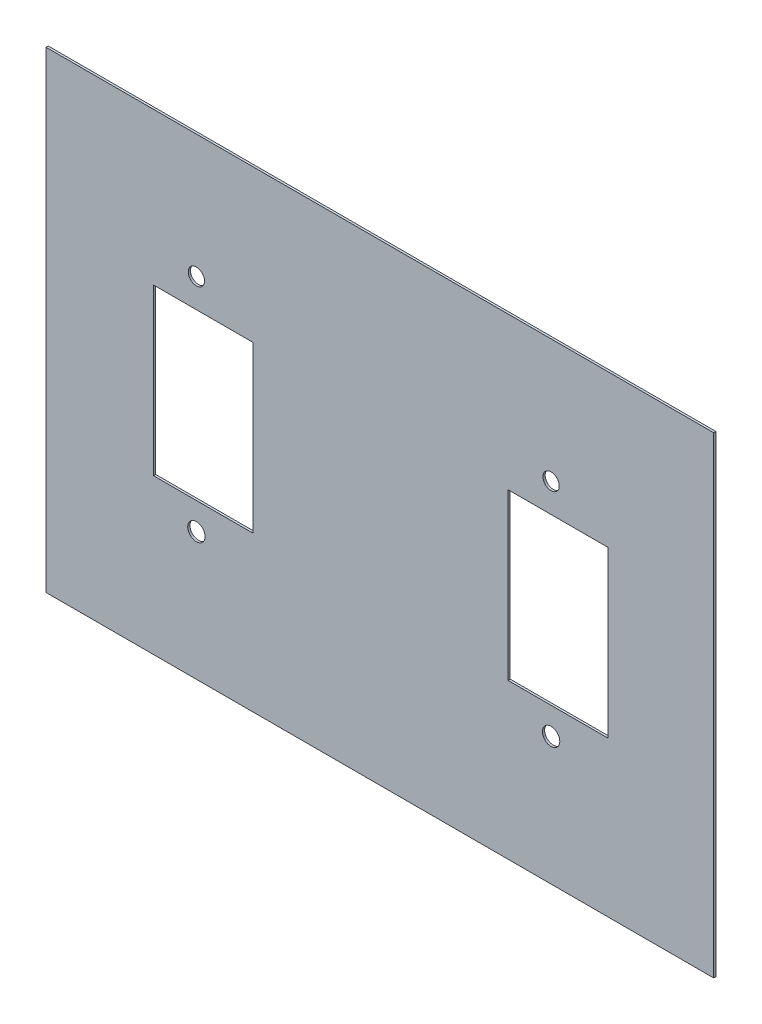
ISO-10303-21;
HEADER;
FILE_DESCRIPTION(('STEP AP214'),'2;1');
FILE_NAME('part.step','',(''),(''),'','','');
FILE_SCHEMA(('AUTOMOTIVE_DESIGN { 1 0 10303 214 1 1 1 1 }'));
ENDSEC;
DATA;
#1=APPLICATION_CONTEXT('core data for automotive mechanical design processes');
#2=APPLICATION_PROTOCOL_DEFINITION('international standard','automotive_design',2000,#1);
#3=PRODUCT_CONTEXT('',#1,'mechanical');
#4=PRODUCT('Part','Part','',(#3));
#5=PRODUCT_RELATED_PRODUCT_CATEGORY('part','',(#4));
#6=PRODUCT_DEFINITION_FORMATION('','',#4);
#7=PRODUCT_DEFINITION_CONTEXT('part definition',#1,'design');
#8=PRODUCT_DEFINITION('design','',#6,#7);
#9=PRODUCT_DEFINITION_SHAPE('','',#8);
#10=(LENGTH_UNIT() NAMED_UNIT(*) SI_UNIT(.MILLI.,.METRE.));
#11=(NAMED_UNIT(*) PLANE_ANGLE_UNIT() SI_UNIT($,.RADIAN.));
#12=(NAMED_UNIT(*) SI_UNIT($,.STERADIAN.) SOLID_ANGLE_UNIT());
#13=UNCERTAINTY_MEASURE_WITH_UNIT(LENGTH_MEASURE(1.E-05),#10,'distance_accuracy_value','');
#14=(GEOMETRIC_REPRESENTATION_CONTEXT(3) GLOBAL_UNCERTAINTY_ASSIGNED_CONTEXT((#13)) GLOBAL_UNIT_ASSIGNED_CONTEXT((#10,
#11,#12)) REPRESENTATION_CONTEXT('',''));
#15=CARTESIAN_POINT('',(0.,0.,0.));
#16=DIRECTION('',(0.,0.,1.));
#17=DIRECTION('',(1.,0.,0.));
#18=AXIS2_PLACEMENT_3D('',#15,#16,#17);
#19=CARTESIAN_POINT('',(-292.934613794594,286.400756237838,2.54));
#20=DIRECTION('',(1.,0.,0.));
#21=DIRECTION('',(0.,0.,-1.));
#22=AXIS2_PLACEMENT_3D('',#19,#20,#21);
#23=PLANE('',#22);
#24=DIRECTION('',(0.,-1.,0.));
#25=VECTOR('',#24,1.);
#26=CARTESIAN_POINT('',(-292.934613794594,286.400756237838,0.));
#27=LINE('',#26,#25);
#28=CARTESIAN_POINT('',(-292.934613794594,286.400756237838,0.));
#29=VERTEX_POINT('',#28);
#30=CARTESIAN_POINT('',(-292.934613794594,-254.618343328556,0.));
#31=VERTEX_POINT('',#30);
#32=EDGE_CURVE('E144',#29,#31,#27,.T.);
#33=ORIENTED_EDGE('',*,*,#32,.T.);
#34=DIRECTION('',(0.,0.,-1.));
#35=VECTOR('',#34,1.);
#36=CARTESIAN_POINT('',(-292.934613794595,-254.618343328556,1662.15136427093));
#37=LINE('',#36,#35);
#38=CARTESIAN_POINT('',(-292.934613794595,-254.618343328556,2.53999999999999));
#39=VERTEX_POINT('',#38);
#40=EDGE_CURVE('E44',#39,#31,#37,.T.);
#41=ORIENTED_EDGE('',*,*,#40,.F.);
#42=DIRECTION('',(0.,-1.,0.));
#43=VECTOR('',#42,1.);
#44=CARTESIAN_POINT('',(-292.934613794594,286.400756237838,2.54));
#45=LINE('',#44,#43);
#46=CARTESIAN_POINT('',(-292.934613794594,286.400756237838,2.54));
#47=VERTEX_POINT('',#46);
#48=EDGE_CURVE('E130',#47,#39,#45,.T.);
#49=ORIENTED_EDGE('',*,*,#48,.F.);
#50=DIRECTION('',(0.,0.,-1.));
#51=VECTOR('',#50,1.);
#52=CARTESIAN_POINT('',(-292.934613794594,286.400756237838,2.54));
#53=LINE('',#52,#51);
#54=EDGE_CURVE('E138',#47,#29,#53,.T.);
#55=ORIENTED_EDGE('',*,*,#54,.T.);
#56=EDGE_LOOP('',(#33,#41,#49,#55));
#57=FACE_BOUND('',#56,.T.);
#58=ADVANCED_FACE('F30',(#57),#23,.F.);
#59=CARTESIAN_POINT('',(472.05362042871,286.400756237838,2.54));
#60=DIRECTION('',(-1.,0.,0.));
#61=DIRECTION('',(0.,-1.,0.));
#62=AXIS2_PLACEMENT_3D('',#59,#60,#61);
#63=PLANE('',#62);
#64=DIRECTION('',(0.,1.,0.));
#65=VECTOR('',#64,1.);
#66=CARTESIAN_POINT('',(472.05362042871,286.400756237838,2.54));
#67=LINE('',#66,#65);
#68=CARTESIAN_POINT('',(472.05362042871,-254.618343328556,2.53999999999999));
#69=VERTEX_POINT('',#68);
#70=CARTESIAN_POINT('',(472.05362042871,286.400756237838,2.54));
#71=VERTEX_POINT('',#70);
#72=EDGE_CURVE('E127',#69,#71,#67,.T.);
#73=ORIENTED_EDGE('',*,*,#72,.F.);
#74=DIRECTION('',(0.,0.,-1.));
#75=VECTOR('',#74,1.);
#76=CARTESIAN_POINT('',(472.05362042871,-254.618343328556,1662.15136427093));
#77=LINE('',#76,#75);
#78=CARTESIAN_POINT('',(472.05362042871,-254.618343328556,0.));
#79=VERTEX_POINT('',#78);
#80=EDGE_CURVE('E115',#69,#79,#77,.T.);
#81=ORIENTED_EDGE('',*,*,#80,.T.);
#82=DIRECTION('',(0.,1.,0.));
#83=VECTOR('',#82,1.);
#84=CARTESIAN_POINT('',(472.05362042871,286.400756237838,0.));
#85=LINE('',#84,#83);
#86=CARTESIAN_POINT('',(472.05362042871,286.400756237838,0.));
#87=VERTEX_POINT('',#86);
#88=EDGE_CURVE('E147',#79,#87,#85,.T.);
#89=ORIENTED_EDGE('',*,*,#88,.T.);
#90=DIRECTION('',(0.,0.,-1.));
#91=VECTOR('',#90,1.);
#92=CARTESIAN_POINT('',(472.05362042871,286.400756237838,2.54));
#93=LINE('',#92,#91);
#94=EDGE_CURVE('E37',#71,#87,#93,.T.);
#95=ORIENTED_EDGE('',*,*,#94,.F.);
#96=EDGE_LOOP('',(#73,#81,#89,#95));
#97=FACE_BOUND('',#96,.T.);
#98=ADVANCED_FACE('F133',(#97),#63,.F.);
#99=CARTESIAN_POINT('',(-292.934613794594,286.400756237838,2.54));
#100=DIRECTION('',(0.,-1.,0.));
#101=DIRECTION('',(0.,0.,-1.));
#102=AXIS2_PLACEMENT_3D('',#99,#100,#101);
#103=PLANE('',#102);
#104=DIRECTION('',(-1.,0.,0.));
#105=VECTOR('',#104,1.);
#106=CARTESIAN_POINT('',(-292.934613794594,286.400756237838,0.));
#107=LINE('',#106,#105);
#108=EDGE_CURVE('E140',#87,#29,#107,.T.);
#109=ORIENTED_EDGE('',*,*,#108,.T.);
#110=ORIENTED_EDGE('',*,*,#54,.F.);
#111=DIRECTION('',(-1.,0.,0.));
#112=VECTOR('',#111,1.);
#113=CARTESIAN_POINT('',(-292.934613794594,286.400756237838,2.54));
#114=LINE('',#113,#112);
#115=EDGE_CURVE('E136',#71,#47,#114,.T.);
#116=ORIENTED_EDGE('',*,*,#115,.F.);
#117=ORIENTED_EDGE('',*,*,#94,.T.);
#118=EDGE_LOOP('',(#109,#110,#116,#117));
#119=FACE_BOUND('',#118,.T.);
#120=ADVANCED_FACE('F154',(#119),#103,.F.);
#121=CARTESIAN_POINT('',(-292.934613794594,-795.63744289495,2.54));
#122=DIRECTION('',(0.,0.,1.));
#123=DIRECTION('',(1.,0.,0.));
#124=AXIS2_PLACEMENT_3D('',#121,#122,#123);
#125=PLANE('',#124);
#126=DIRECTION('',(-1.,0.,0.));
#127=VECTOR('',#126,1.);
#128=CARTESIAN_POINT('',(-292.934613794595,-254.618343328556,2.54));
#129=LINE('',#128,#127);
#130=EDGE_CURVE('E118',#69,#39,#129,.T.);
#131=ORIENTED_EDGE('',*,*,#130,.F.);
#132=ORIENTED_EDGE('',*,*,#72,.T.);
#133=ORIENTED_EDGE('',*,*,#115,.T.);
#134=ORIENTED_EDGE('',*,*,#48,.T.);
#135=EDGE_LOOP('',(#131,#132,#133,#134));
#136=FACE_BOUND('',#135,.T.);
#137=CARTESIAN_POINT('',(285.716630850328,-108.095305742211,2.54));
#138=DIRECTION('',(0.,0.,1.));
#139=DIRECTION('',(1.,0.,0.));
#140=AXIS2_PLACEMENT_3D('',#137,#138,#139);
#141=CIRCLE('',#140,9.95883906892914);
#142=CARTESIAN_POINT('',(295.675469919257,-108.095305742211,2.54));
#143=VERTEX_POINT('',#142);
#144=EDGE_CURVE('E131',#143,#143,#141,.T.);
#145=ORIENTED_EDGE('',*,*,#144,.F.);
#146=EDGE_LOOP('',(#145));
#147=FACE_BOUND('',#146,.T.);
#148=CARTESIAN_POINT('',(285.716630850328,145.099046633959,2.54));
#149=DIRECTION('',(0.,0.,1.));
#150=DIRECTION('',(1.,0.,0.));
#151=AXIS2_PLACEMENT_3D('',#148,#149,#150);
#152=CIRCLE('',#151,9.33473781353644);
#153=CARTESIAN_POINT('',(295.051368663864,145.099046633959,2.54));
#154=VERTEX_POINT('',#153);
#155=EDGE_CURVE('E165',#154,#154,#152,.T.);
#156=ORIENTED_EDGE('',*,*,#155,.F.);
#157=EDGE_LOOP('',(#156));
#158=FACE_BOUND('',#157,.T.);
#159=DIRECTION('',(0.,-1.,0.));
#160=VECTOR('',#159,1.);
#161=CARTESIAN_POINT('',(236.32626016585,112.096614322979,2.54));
#162=LINE('',#161,#160);
#163=CARTESIAN_POINT('',(236.32626016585,112.096614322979,2.54));
#164=VERTEX_POINT('',#163);
#165=CARTESIAN_POINT('',(236.32626016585,-77.1861627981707,2.54));
#166=VERTEX_POINT('',#165);
#167=EDGE_CURVE('E51',#164,#166,#162,.T.);
#168=ORIENTED_EDGE('',*,*,#167,.F.);
#169=DIRECTION('',(-1.,0.,0.));
#170=VECTOR('',#169,1.);
#171=CARTESIAN_POINT('',(236.32626016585,112.096614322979,2.54));
#172=LINE('',#171,#170);
#173=CARTESIAN_POINT('',(350.752480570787,112.096614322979,2.54));
#174=VERTEX_POINT('',#173);
#175=EDGE_CURVE('E177',#174,#164,#172,.T.);
#176=ORIENTED_EDGE('',*,*,#175,.F.);
#177=DIRECTION('',(0.,1.,0.));
#178=VECTOR('',#177,1.);
#179=CARTESIAN_POINT('',(350.752480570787,112.096614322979,2.54));
#180=LINE('',#179,#178);
#181=CARTESIAN_POINT('',(350.752480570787,-77.1861627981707,2.54));
#182=VERTEX_POINT('',#181);
#183=EDGE_CURVE('E191',#182,#174,#180,.T.);
#184=ORIENTED_EDGE('',*,*,#183,.F.);
#185=DIRECTION('',(1.,0.,0.));
#186=VECTOR('',#185,1.);
#187=CARTESIAN_POINT('',(236.32626016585,-77.1861627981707,2.54));
#188=LINE('',#187,#186);
#189=EDGE_CURVE('E188',#166,#182,#188,.T.);
#190=ORIENTED_EDGE('',*,*,#189,.F.);
#191=EDGE_LOOP('',(#168,#176,#184,#190));
#192=FACE_BOUND('',#191,.T.);
#193=CARTESIAN_POINT('',(-120.683369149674,-108.095305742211,2.54));
#194=DIRECTION('',(0.,0.,1.));
#195=DIRECTION('',(1.,0.,0.));
#196=AXIS2_PLACEMENT_3D('',#193,#194,#195);
#197=CIRCLE('',#196,9.95883906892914);
#198=CARTESIAN_POINT('',(-110.724530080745,-108.095305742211,2.54));
#199=VERTEX_POINT('',#198);
#200=EDGE_CURVE('E198',#199,#199,#197,.T.);
#201=ORIENTED_EDGE('',*,*,#200,.F.);
#202=EDGE_LOOP('',(#201));
#203=FACE_BOUND('',#202,.T.);
#204=CARTESIAN_POINT('',(-120.683369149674,145.099046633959,2.54));
#205=DIRECTION('',(0.,0.,1.));
#206=DIRECTION('',(1.,0.,0.));
#207=AXIS2_PLACEMENT_3D('',#204,#205,#206);
#208=CIRCLE('',#207,9.33473781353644);
#209=CARTESIAN_POINT('',(-111.348631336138,145.099046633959,2.54));
#210=VERTEX_POINT('',#209);
#211=EDGE_CURVE('E207',#210,#210,#208,.T.);
#212=ORIENTED_EDGE('',*,*,#211,.F.);
#213=EDGE_LOOP('',(#212));
#214=FACE_BOUND('',#213,.T.);
#215=DIRECTION('',(0.,-1.,0.));
#216=VECTOR('',#215,1.);
#217=CARTESIAN_POINT('',(-170.073739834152,112.096614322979,2.54));
#218=LINE('',#217,#216);
#219=CARTESIAN_POINT('',(-170.073739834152,112.096614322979,2.54));
#220=VERTEX_POINT('',#219);
#221=CARTESIAN_POINT('',(-170.073739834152,-77.1861627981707,2.54));
#222=VERTEX_POINT('',#221);
#223=EDGE_CURVE('E213',#220,#222,#218,.T.);
#224=ORIENTED_EDGE('',*,*,#223,.F.);
#225=DIRECTION('',(-1.,0.,0.));
#226=VECTOR('',#225,1.);
#227=CARTESIAN_POINT('',(-170.073739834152,112.096614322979,2.54));
#228=LINE('',#227,#226);
#229=CARTESIAN_POINT('',(-55.6475194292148,112.096614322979,2.54));
#230=VERTEX_POINT('',#229);
#231=EDGE_CURVE('E220',#230,#220,#228,.T.);
#232=ORIENTED_EDGE('',*,*,#231,.F.);
#233=DIRECTION('',(0.,1.,0.));
#234=VECTOR('',#233,1.);
#235=CARTESIAN_POINT('',(-55.6475194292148,112.096614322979,2.54));
#236=LINE('',#235,#234);
#237=CARTESIAN_POINT('',(-55.6475194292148,-77.1861627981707,2.54));
#238=VERTEX_POINT('',#237);
#239=EDGE_CURVE('E234',#238,#230,#236,.T.);
#240=ORIENTED_EDGE('',*,*,#239,.F.);
#241=DIRECTION('',(1.,0.,0.));
#242=VECTOR('',#241,1.);
#243=CARTESIAN_POINT('',(-170.073739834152,-77.1861627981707,2.54));
#244=LINE('',#243,#242);
#245=EDGE_CURVE('E231',#222,#238,#244,.T.);
#246=ORIENTED_EDGE('',*,*,#245,.F.);
#247=EDGE_LOOP('',(#224,#232,#240,#246));
#248=FACE_BOUND('',#247,.T.);
#249=ADVANCED_FACE('F125',(#136,#147,#158,#192,#203,#214,#248),#125,.T.);
#250=CARTESIAN_POINT('',(-292.934613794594,-795.63744289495,0.));
#251=DIRECTION('',(0.,0.,1.));
#252=DIRECTION('',(1.,0.,0.));
#253=AXIS2_PLACEMENT_3D('',#250,#251,#252);
#254=PLANE('',#253);
#255=CARTESIAN_POINT('',(285.716630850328,-108.095305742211,0.));
#256=DIRECTION('',(0.,0.,1.));
#257=DIRECTION('',(1.,0.,0.));
#258=AXIS2_PLACEMENT_3D('',#255,#256,#257);
#259=CIRCLE('',#258,9.95883906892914);
#260=CARTESIAN_POINT('',(295.675469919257,-108.095305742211,0.));
#261=VERTEX_POINT('',#260);
#262=EDGE_CURVE('E162',#261,#261,#259,.T.);
#263=ORIENTED_EDGE('',*,*,#262,.T.);
#264=EDGE_LOOP('',(#263));
#265=FACE_BOUND('',#264,.T.);
#266=CARTESIAN_POINT('',(285.716630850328,145.099046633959,0.));
#267=DIRECTION('',(0.,0.,1.));
#268=DIRECTION('',(1.,0.,0.));
#269=AXIS2_PLACEMENT_3D('',#266,#267,#268);
#270=CIRCLE('',#269,9.33473781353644);
#271=CARTESIAN_POINT('',(295.051368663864,145.099046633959,0.));
#272=VERTEX_POINT('',#271);
#273=EDGE_CURVE('E168',#272,#272,#270,.T.);
#274=ORIENTED_EDGE('',*,*,#273,.T.);
#275=EDGE_LOOP('',(#274));
#276=FACE_BOUND('',#275,.T.);
#277=DIRECTION('',(-1.,0.,0.));
#278=VECTOR('',#277,1.);
#279=CARTESIAN_POINT('',(236.32626016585,112.096614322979,0.));
#280=LINE('',#279,#278);
#281=CARTESIAN_POINT('',(350.752480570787,112.096614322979,0.));
#282=VERTEX_POINT('',#281);
#283=CARTESIAN_POINT('',(236.32626016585,112.096614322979,0.));
#284=VERTEX_POINT('',#283);
#285=EDGE_CURVE('E183',#282,#284,#280,.T.);
#286=ORIENTED_EDGE('',*,*,#285,.T.);
#287=DIRECTION('',(0.,-1.,0.));
#288=VECTOR('',#287,1.);
#289=CARTESIAN_POINT('',(236.32626016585,112.096614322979,0.));
#290=LINE('',#289,#288);
#291=CARTESIAN_POINT('',(236.32626016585,-77.1861627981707,0.));
#292=VERTEX_POINT('',#291);
#293=EDGE_CURVE('E173',#284,#292,#290,.T.);
#294=ORIENTED_EDGE('',*,*,#293,.T.);
#295=DIRECTION('',(1.,0.,0.));
#296=VECTOR('',#295,1.);
#297=CARTESIAN_POINT('',(236.32626016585,-77.1861627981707,0.));
#298=LINE('',#297,#296);
#299=CARTESIAN_POINT('',(350.752480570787,-77.1861627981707,0.));
#300=VERTEX_POINT('',#299);
#301=EDGE_CURVE('E176',#292,#300,#298,.T.);
#302=ORIENTED_EDGE('',*,*,#301,.T.);
#303=DIRECTION('',(0.,1.,0.));
#304=VECTOR('',#303,1.);
#305=CARTESIAN_POINT('',(350.752480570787,112.096614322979,0.));
#306=LINE('',#305,#304);
#307=EDGE_CURVE('E180',#300,#282,#306,.T.);
#308=ORIENTED_EDGE('',*,*,#307,.T.);
#309=EDGE_LOOP('',(#286,#294,#302,#308));
#310=FACE_BOUND('',#309,.T.);
#311=CARTESIAN_POINT('',(-120.683369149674,-108.095305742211,0.));
#312=DIRECTION('',(0.,0.,1.));
#313=DIRECTION('',(1.,0.,0.));
#314=AXIS2_PLACEMENT_3D('',#311,#312,#313);
#315=CIRCLE('',#314,9.95883906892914);
#316=CARTESIAN_POINT('',(-110.724530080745,-108.095305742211,0.));
#317=VERTEX_POINT('',#316);
#318=EDGE_CURVE('E204',#317,#317,#315,.T.);
#319=ORIENTED_EDGE('',*,*,#318,.T.);
#320=EDGE_LOOP('',(#319));
#321=FACE_BOUND('',#320,.T.);
#322=CARTESIAN_POINT('',(-120.683369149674,145.099046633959,0.));
#323=DIRECTION('',(0.,0.,1.));
#324=DIRECTION('',(1.,0.,0.));
#325=AXIS2_PLACEMENT_3D('',#322,#323,#324);
#326=CIRCLE('',#325,9.33473781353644);
#327=CARTESIAN_POINT('',(-111.348631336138,145.099046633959,0.));
#328=VERTEX_POINT('',#327);
#329=EDGE_CURVE('E210',#328,#328,#326,.T.);
#330=ORIENTED_EDGE('',*,*,#329,.T.);
#331=EDGE_LOOP('',(#330));
#332=FACE_BOUND('',#331,.T.);
#333=DIRECTION('',(-1.,0.,0.));
#334=VECTOR('',#333,1.);
#335=CARTESIAN_POINT('',(-170.073739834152,112.096614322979,0.));
#336=LINE('',#335,#334);
#337=CARTESIAN_POINT('',(-55.6475194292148,112.096614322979,0.));
#338=VERTEX_POINT('',#337);
#339=CARTESIAN_POINT('',(-170.073739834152,112.096614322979,0.));
#340=VERTEX_POINT('',#339);
#341=EDGE_CURVE('E226',#338,#340,#336,.T.);
#342=ORIENTED_EDGE('',*,*,#341,.T.);
#343=DIRECTION('',(0.,-1.,0.));
#344=VECTOR('',#343,1.);
#345=CARTESIAN_POINT('',(-170.073739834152,112.096614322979,0.));
#346=LINE('',#345,#344);
#347=CARTESIAN_POINT('',(-170.073739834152,-77.1861627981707,0.));
#348=VERTEX_POINT('',#347);
#349=EDGE_CURVE('E216',#340,#348,#346,.T.);
#350=ORIENTED_EDGE('',*,*,#349,.T.);
#351=DIRECTION('',(1.,0.,0.));
#352=VECTOR('',#351,1.);
#353=CARTESIAN_POINT('',(-170.073739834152,-77.1861627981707,0.));
#354=LINE('',#353,#352);
#355=CARTESIAN_POINT('',(-55.6475194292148,-77.1861627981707,0.));
#356=VERTEX_POINT('',#355);
#357=EDGE_CURVE('E219',#348,#356,#354,.T.);
#358=ORIENTED_EDGE('',*,*,#357,.T.);
#359=DIRECTION('',(0.,1.,0.));
#360=VECTOR('',#359,1.);
#361=CARTESIAN_POINT('',(-55.6475194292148,112.096614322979,0.));
#362=LINE('',#361,#360);
#363=EDGE_CURVE('E223',#356,#338,#362,.T.);
#364=ORIENTED_EDGE('',*,*,#363,.T.);
#365=EDGE_LOOP('',(#342,#350,#358,#364));
#366=FACE_BOUND('',#365,.T.);
#367=ORIENTED_EDGE('',*,*,#88,.F.);
#368=DIRECTION('',(-1.,0.,0.));
#369=VECTOR('',#368,1.);
#370=CARTESIAN_POINT('',(-292.934613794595,-254.618343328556,0.));
#371=LINE('',#370,#369);
#372=EDGE_CURVE('E11',#79,#31,#371,.T.);
#373=ORIENTED_EDGE('',*,*,#372,.T.);
#374=ORIENTED_EDGE('',*,*,#32,.F.);
#375=ORIENTED_EDGE('',*,*,#108,.F.);
#376=EDGE_LOOP('',(#367,#373,#374,#375));
#377=FACE_BOUND('',#376,.T.);
#378=ADVANCED_FACE('F158',(#265,#276,#310,#321,#332,#366,#377),#254,.F.);
#379=CARTESIAN_POINT('',(-170.073739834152,112.096614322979,0.));
#380=DIRECTION('',(-1.,0.,0.));
#381=DIRECTION('',(0.,0.,1.));
#382=AXIS2_PLACEMENT_3D('',#379,#380,#381);
#383=PLANE('',#382);
#384=ORIENTED_EDGE('',*,*,#223,.T.);
#385=DIRECTION('',(0.,0.,1.));
#386=VECTOR('',#385,1.);
#387=CARTESIAN_POINT('',(-170.073739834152,-77.1861627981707,0.));
#388=LINE('',#387,#386);
#389=EDGE_CURVE('E229',#348,#222,#388,.T.);
#390=ORIENTED_EDGE('',*,*,#389,.F.);
#391=ORIENTED_EDGE('',*,*,#349,.F.);
#392=DIRECTION('',(0.,0.,1.));
#393=VECTOR('',#392,1.);
#394=CARTESIAN_POINT('',(-170.073739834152,112.096614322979,0.));
#395=LINE('',#394,#393);
#396=EDGE_CURVE('E148',#340,#220,#395,.T.);
#397=ORIENTED_EDGE('',*,*,#396,.T.);
#398=EDGE_LOOP('',(#384,#390,#391,#397));
#399=FACE_BOUND('',#398,.T.);
#400=ADVANCED_FACE('F259',(#399),#383,.F.);
#401=CARTESIAN_POINT('',(-170.073739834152,112.096614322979,0.));
#402=DIRECTION('',(0.,1.,0.));
#403=DIRECTION('',(0.,0.,1.));
#404=AXIS2_PLACEMENT_3D('',#401,#402,#403);
#405=PLANE('',#404);
#406=ORIENTED_EDGE('',*,*,#231,.T.);
#407=ORIENTED_EDGE('',*,*,#396,.F.);
#408=ORIENTED_EDGE('',*,*,#341,.F.);
#409=DIRECTION('',(0.,0.,1.));
#410=VECTOR('',#409,1.);
#411=CARTESIAN_POINT('',(-55.6475194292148,112.096614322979,0.));
#412=LINE('',#411,#410);
#413=EDGE_CURVE('E240',#338,#230,#412,.T.);
#414=ORIENTED_EDGE('',*,*,#413,.T.);
#415=EDGE_LOOP('',(#406,#407,#408,#414));
#416=FACE_BOUND('',#415,.T.);
#417=ADVANCED_FACE('F261',(#416),#405,.F.);
#418=CARTESIAN_POINT('',(-55.6475194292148,112.096614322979,0.));
#419=DIRECTION('',(1.,0.,0.));
#420=DIRECTION('',(0.,0.,-1.));
#421=AXIS2_PLACEMENT_3D('',#418,#419,#420);
#422=PLANE('',#421);
#423=ORIENTED_EDGE('',*,*,#239,.T.);
#424=ORIENTED_EDGE('',*,*,#413,.F.);
#425=ORIENTED_EDGE('',*,*,#363,.F.);
#426=DIRECTION('',(0.,0.,1.));
#427=VECTOR('',#426,1.);
#428=CARTESIAN_POINT('',(-55.6475194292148,-77.1861627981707,0.));
#429=LINE('',#428,#427);
#430=EDGE_CURVE('E242',#356,#238,#429,.T.);
#431=ORIENTED_EDGE('',*,*,#430,.T.);
#432=EDGE_LOOP('',(#423,#424,#425,#431));
#433=FACE_BOUND('',#432,.T.);
#434=ADVANCED_FACE('F256',(#433),#422,.F.);
#435=CARTESIAN_POINT('',(-170.073739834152,-77.1861627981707,0.));
#436=DIRECTION('',(0.,-1.,0.));
#437=DIRECTION('',(0.,0.,-1.));
#438=AXIS2_PLACEMENT_3D('',#435,#436,#437);
#439=PLANE('',#438);
#440=ORIENTED_EDGE('',*,*,#245,.T.);
#441=ORIENTED_EDGE('',*,*,#430,.F.);
#442=ORIENTED_EDGE('',*,*,#357,.F.);
#443=ORIENTED_EDGE('',*,*,#389,.T.);
#444=EDGE_LOOP('',(#440,#441,#442,#443));
#445=FACE_BOUND('',#444,.T.);
#446=ADVANCED_FACE('F247',(#445),#439,.F.);
#447=CARTESIAN_POINT('',(-120.683369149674,145.099046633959,0.));
#448=DIRECTION('',(0.,0.,1.));
#449=DIRECTION('',(1.,0.,0.));
#450=AXIS2_PLACEMENT_3D('',#447,#448,#449);
#451=CYLINDRICAL_SURFACE('',#450,9.33473781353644);
#452=ORIENTED_EDGE('',*,*,#329,.F.);
#453=EDGE_LOOP('',(#452));
#454=FACE_BOUND('',#453,.T.);
#455=ORIENTED_EDGE('',*,*,#211,.T.);
#456=EDGE_LOOP('',(#455));
#457=FACE_BOUND('',#456,.T.);
#458=ADVANCED_FACE('F286',(#454,#457),#451,.F.);
#459=CARTESIAN_POINT('',(-120.683369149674,-108.095305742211,0.));
#460=DIRECTION('',(0.,0.,1.));
#461=DIRECTION('',(1.,0.,0.));
#462=AXIS2_PLACEMENT_3D('',#459,#460,#461);
#463=CYLINDRICAL_SURFACE('',#462,9.95883906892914);
#464=ORIENTED_EDGE('',*,*,#318,.F.);
#465=EDGE_LOOP('',(#464));
#466=FACE_BOUND('',#465,.T.);
#467=ORIENTED_EDGE('',*,*,#200,.T.);
#468=EDGE_LOOP('',(#467));
#469=FACE_BOUND('',#468,.T.);
#470=ADVANCED_FACE('F290',(#466,#469),#463,.F.);
#471=CARTESIAN_POINT('',(236.32626016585,112.096614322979,0.));
#472=DIRECTION('',(-1.,0.,0.));
#473=DIRECTION('',(0.,0.,1.));
#474=AXIS2_PLACEMENT_3D('',#471,#472,#473);
#475=PLANE('',#474);
#476=ORIENTED_EDGE('',*,*,#167,.T.);
#477=DIRECTION('',(0.,0.,1.));
#478=VECTOR('',#477,1.);
#479=CARTESIAN_POINT('',(236.32626016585,-77.1861627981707,0.));
#480=LINE('',#479,#478);
#481=EDGE_CURVE('E186',#292,#166,#480,.T.);
#482=ORIENTED_EDGE('',*,*,#481,.F.);
#483=ORIENTED_EDGE('',*,*,#293,.F.);
#484=DIRECTION('',(0.,0.,1.));
#485=VECTOR('',#484,1.);
#486=CARTESIAN_POINT('',(236.32626016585,112.096614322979,0.));
#487=LINE('',#486,#485);
#488=EDGE_CURVE('E196',#284,#164,#487,.T.);
#489=ORIENTED_EDGE('',*,*,#488,.T.);
#490=EDGE_LOOP('',(#476,#482,#483,#489));
#491=FACE_BOUND('',#490,.T.);
#492=ADVANCED_FACE('F295',(#491),#475,.F.);
#493=CARTESIAN_POINT('',(236.32626016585,112.096614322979,0.));
#494=DIRECTION('',(0.,1.,0.));
#495=DIRECTION('',(0.,0.,1.));
#496=AXIS2_PLACEMENT_3D('',#493,#494,#495);
#497=PLANE('',#496);
#498=ORIENTED_EDGE('',*,*,#175,.T.);
#499=ORIENTED_EDGE('',*,*,#488,.F.);
#500=ORIENTED_EDGE('',*,*,#285,.F.);
#501=DIRECTION('',(0.,0.,1.));
#502=VECTOR('',#501,1.);
#503=CARTESIAN_POINT('',(350.752480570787,112.096614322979,0.));
#504=LINE('',#503,#502);
#505=EDGE_CURVE('E199',#282,#174,#504,.T.);
#506=ORIENTED_EDGE('',*,*,#505,.T.);
#507=EDGE_LOOP('',(#498,#499,#500,#506));
#508=FACE_BOUND('',#507,.T.);
#509=ADVANCED_FACE('F303',(#508),#497,.F.);
#510=CARTESIAN_POINT('',(350.752480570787,112.096614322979,0.));
#511=DIRECTION('',(1.,0.,0.));
#512=DIRECTION('',(0.,0.,-1.));
#513=AXIS2_PLACEMENT_3D('',#510,#511,#512);
#514=PLANE('',#513);
#515=ORIENTED_EDGE('',*,*,#183,.T.);
#516=ORIENTED_EDGE('',*,*,#505,.F.);
#517=ORIENTED_EDGE('',*,*,#307,.F.);
#518=DIRECTION('',(0.,0.,1.));
#519=VECTOR('',#518,1.);
#520=CARTESIAN_POINT('',(350.752480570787,-77.1861627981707,0.));
#521=LINE('',#520,#519);
#522=EDGE_CURVE('E201',#300,#182,#521,.T.);
#523=ORIENTED_EDGE('',*,*,#522,.T.);
#524=EDGE_LOOP('',(#515,#516,#517,#523));
#525=FACE_BOUND('',#524,.T.);
#526=ADVANCED_FACE('F308',(#525),#514,.F.);
#527=CARTESIAN_POINT('',(236.32626016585,-77.1861627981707,0.));
#528=DIRECTION('',(0.,-1.,0.));
#529=DIRECTION('',(0.,0.,-1.));
#530=AXIS2_PLACEMENT_3D('',#527,#528,#529);
#531=PLANE('',#530);
#532=ORIENTED_EDGE('',*,*,#189,.T.);
#533=ORIENTED_EDGE('',*,*,#522,.F.);
#534=ORIENTED_EDGE('',*,*,#301,.F.);
#535=ORIENTED_EDGE('',*,*,#481,.T.);
#536=EDGE_LOOP('',(#532,#533,#534,#535));
#537=FACE_BOUND('',#536,.T.);
#538=ADVANCED_FACE('F304',(#537),#531,.F.);
#539=CARTESIAN_POINT('',(285.716630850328,145.099046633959,0.));
#540=DIRECTION('',(0.,0.,1.));
#541=DIRECTION('',(1.,0.,0.));
#542=AXIS2_PLACEMENT_3D('',#539,#540,#541);
#543=CYLINDRICAL_SURFACE('',#542,9.33473781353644);
#544=ORIENTED_EDGE('',*,*,#273,.F.);
#545=EDGE_LOOP('',(#544));
#546=FACE_BOUND('',#545,.T.);
#547=ORIENTED_EDGE('',*,*,#155,.T.);
#548=EDGE_LOOP('',(#547));
#549=FACE_BOUND('',#548,.T.);
#550=ADVANCED_FACE('F307',(#546,#549),#543,.F.);
#551=CARTESIAN_POINT('',(285.716630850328,-108.095305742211,0.));
#552=DIRECTION('',(0.,0.,1.));
#553=DIRECTION('',(1.,0.,0.));
#554=AXIS2_PLACEMENT_3D('',#551,#552,#553);
#555=CYLINDRICAL_SURFACE('',#554,9.95883906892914);
#556=ORIENTED_EDGE('',*,*,#262,.F.);
#557=EDGE_LOOP('',(#556));
#558=FACE_BOUND('',#557,.T.);
#559=ORIENTED_EDGE('',*,*,#144,.T.);
#560=EDGE_LOOP('',(#559));
#561=FACE_BOUND('',#560,.T.);
#562=ADVANCED_FACE('F318',(#558,#561),#555,.F.);
#563=CARTESIAN_POINT('',(-292.934613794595,-254.618343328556,1662.15136427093));
#564=DIRECTION('',(0.,1.,0.));
#565=DIRECTION('',(-1.,0.,0.));
#566=AXIS2_PLACEMENT_3D('',#563,#564,#565);
#567=PLANE('',#566);
#568=ORIENTED_EDGE('',*,*,#80,.F.);
#569=ORIENTED_EDGE('',*,*,#130,.T.);
#570=ORIENTED_EDGE('',*,*,#40,.T.);
#571=ORIENTED_EDGE('',*,*,#372,.F.);
#572=EDGE_LOOP('',(#568,#569,#570,#571));
#573=FACE_BOUND('',#572,.T.);
#574=ADVANCED_FACE('F117',(#573),#567,.F.);
#575=CLOSED_SHELL('',(#58,#98,#120,#249,#378,#400,#417,#434,#446,#458,#470,#492,#509,#526,#538,
#550,#562,#574));
#576=MANIFOLD_SOLID_BREP('B2',#575);
#577=ADVANCED_BREP_SHAPE_REPRESENTATION('',(#18,#576),#14);
#578=SHAPE_DEFINITION_REPRESENTATION(#9,#577);
ENDSEC;
END-ISO-10303-21;
